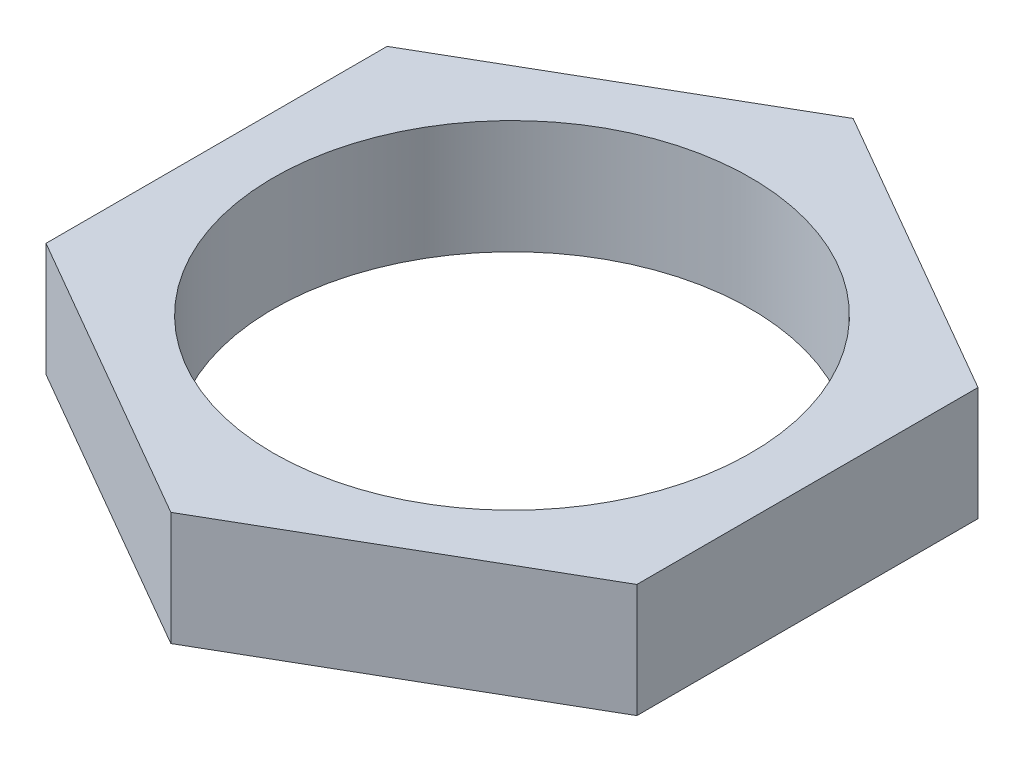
ISO-10303-21;
HEADER;
FILE_DESCRIPTION(('STEP AP214'),'2;1');
FILE_NAME('part.step','',(''),(''),'','','');
FILE_SCHEMA(('AUTOMOTIVE_DESIGN { 1 0 10303 214 1 1 1 1 }'));
ENDSEC;
DATA;
#1=APPLICATION_CONTEXT('core data for automotive mechanical design processes');
#2=APPLICATION_PROTOCOL_DEFINITION('international standard','automotive_design',2000,#1);
#3=PRODUCT_CONTEXT('',#1,'mechanical');
#4=PRODUCT('Part','Part','',(#3));
#5=PRODUCT_RELATED_PRODUCT_CATEGORY('part','',(#4));
#6=PRODUCT_DEFINITION_FORMATION('','',#4);
#7=PRODUCT_DEFINITION_CONTEXT('part definition',#1,'design');
#8=PRODUCT_DEFINITION('design','',#6,#7);
#9=PRODUCT_DEFINITION_SHAPE('','',#8);
#10=(LENGTH_UNIT() NAMED_UNIT(*) SI_UNIT(.MILLI.,.METRE.));
#11=(NAMED_UNIT(*) PLANE_ANGLE_UNIT() SI_UNIT($,.RADIAN.));
#12=(NAMED_UNIT(*) SI_UNIT($,.STERADIAN.) SOLID_ANGLE_UNIT());
#13=UNCERTAINTY_MEASURE_WITH_UNIT(LENGTH_MEASURE(1.E-05),#10,'distance_accuracy_value','');
#14=(GEOMETRIC_REPRESENTATION_CONTEXT(3) GLOBAL_UNCERTAINTY_ASSIGNED_CONTEXT((#13)) GLOBAL_UNIT_ASSIGNED_CONTEXT((#10,
#11,#12)) REPRESENTATION_CONTEXT('',''));
#15=CARTESIAN_POINT('',(0.,0.,0.));
#16=DIRECTION('',(0.,0.,1.));
#17=DIRECTION('',(1.,0.,0.));
#18=AXIS2_PLACEMENT_3D('',#15,#16,#17);
#19=CARTESIAN_POINT('',(0.,5.,0.));
#20=DIRECTION('',(0.,1.,0.));
#21=DIRECTION('',(0.,0.,1.));
#22=AXIS2_PLACEMENT_3D('',#19,#20,#21);
#23=PLANE('',#22);
#24=DIRECTION('',(-0.866025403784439,0.,-0.5));
#25=VECTOR('',#24,1.);
#26=CARTESIAN_POINT('',(13.,5.,-7.50555349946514));
#27=LINE('',#26,#25);
#28=CARTESIAN_POINT('',(13.,5.,-7.50555349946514));
#29=VERTEX_POINT('',#28);
#30=CARTESIAN_POINT('',(0.,5.,-15.0111069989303));
#31=VERTEX_POINT('',#30);
#32=EDGE_CURVE('E129',#29,#31,#27,.T.);
#33=ORIENTED_EDGE('',*,*,#32,.T.);
#34=DIRECTION('',(-0.866025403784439,0.,0.5));
#35=VECTOR('',#34,1.);
#36=CARTESIAN_POINT('',(0.,5.,-15.0111069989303));
#37=LINE('',#36,#35);
#38=CARTESIAN_POINT('',(-13.,5.,-7.50555349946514));
#39=VERTEX_POINT('',#38);
#40=EDGE_CURVE('E87',#31,#39,#37,.T.);
#41=ORIENTED_EDGE('',*,*,#40,.T.);
#42=DIRECTION('',(0.,0.,1.));
#43=VECTOR('',#42,1.);
#44=CARTESIAN_POINT('',(-13.,5.,-7.50555349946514));
#45=LINE('',#44,#43);
#46=CARTESIAN_POINT('',(-13.,5.,7.50555349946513));
#47=VERTEX_POINT('',#46);
#48=EDGE_CURVE('E100',#39,#47,#45,.T.);
#49=ORIENTED_EDGE('',*,*,#48,.T.);
#50=DIRECTION('',(0.866025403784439,0.,0.5));
#51=VECTOR('',#50,1.);
#52=CARTESIAN_POINT('',(-13.,5.,7.50555349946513));
#53=LINE('',#52,#51);
#54=CARTESIAN_POINT('',(0.,5.,15.0111069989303));
#55=VERTEX_POINT('',#54);
#56=EDGE_CURVE('E94',#47,#55,#53,.T.);
#57=ORIENTED_EDGE('',*,*,#56,.T.);
#58=DIRECTION('',(0.866025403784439,0.,-0.5));
#59=VECTOR('',#58,1.);
#60=CARTESIAN_POINT('',(0.,5.,15.0111069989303));
#61=LINE('',#60,#59);
#62=CARTESIAN_POINT('',(13.,5.,7.50555349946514));
#63=VERTEX_POINT('',#62);
#64=EDGE_CURVE('E98',#55,#63,#61,.T.);
#65=ORIENTED_EDGE('',*,*,#64,.T.);
#66=DIRECTION('',(0.,0.,-1.));
#67=VECTOR('',#66,1.);
#68=CARTESIAN_POINT('',(13.,5.,7.50555349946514));
#69=LINE('',#68,#67);
#70=EDGE_CURVE('E50',#63,#29,#69,.T.);
#71=ORIENTED_EDGE('',*,*,#70,.T.);
#72=EDGE_LOOP('',(#33,#41,#49,#57,#65,#71));
#73=FACE_BOUND('',#72,.T.);
#74=CARTESIAN_POINT('',(0.,5.,0.));
#75=DIRECTION('',(0.,1.,0.));
#76=DIRECTION('',(0.,0.,1.));
#77=AXIS2_PLACEMENT_3D('',#74,#75,#76);
#78=CIRCLE('',#77,10.5);
#79=CARTESIAN_POINT('',(0.,5.,10.5));
#80=VERTEX_POINT('',#79);
#81=EDGE_CURVE('E122',#80,#80,#78,.T.);
#82=ORIENTED_EDGE('',*,*,#81,.F.);
#83=EDGE_LOOP('',(#82));
#84=FACE_BOUND('',#83,.T.);
#85=ADVANCED_FACE('F33',(#73,#84),#23,.T.);
#86=CARTESIAN_POINT('',(0.,0.,0.));
#87=DIRECTION('',(0.,1.,0.));
#88=DIRECTION('',(0.,0.,1.));
#89=AXIS2_PLACEMENT_3D('',#86,#87,#88);
#90=PLANE('',#89);
#91=DIRECTION('',(-0.866025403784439,0.,-0.5));
#92=VECTOR('',#91,1.);
#93=CARTESIAN_POINT('',(13.,0.,-7.50555349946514));
#94=LINE('',#93,#92);
#95=CARTESIAN_POINT('',(13.,0.,-7.50555349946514));
#96=VERTEX_POINT('',#95);
#97=CARTESIAN_POINT('',(0.,0.,-15.0111069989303));
#98=VERTEX_POINT('',#97);
#99=EDGE_CURVE('E118',#96,#98,#94,.T.);
#100=ORIENTED_EDGE('',*,*,#99,.F.);
#101=DIRECTION('',(0.,0.,-1.));
#102=VECTOR('',#101,1.);
#103=CARTESIAN_POINT('',(13.,0.,7.50555349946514));
#104=LINE('',#103,#102);
#105=CARTESIAN_POINT('',(13.,0.,7.50555349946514));
#106=VERTEX_POINT('',#105);
#107=EDGE_CURVE('E79',#106,#96,#104,.T.);
#108=ORIENTED_EDGE('',*,*,#107,.F.);
#109=DIRECTION('',(0.866025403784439,0.,-0.5));
#110=VECTOR('',#109,1.);
#111=CARTESIAN_POINT('',(0.,0.,15.0111069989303));
#112=LINE('',#111,#110);
#113=CARTESIAN_POINT('',(0.,0.,15.0111069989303));
#114=VERTEX_POINT('',#113);
#115=EDGE_CURVE('E73',#114,#106,#112,.T.);
#116=ORIENTED_EDGE('',*,*,#115,.F.);
#117=DIRECTION('',(0.866025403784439,0.,0.5));
#118=VECTOR('',#117,1.);
#119=CARTESIAN_POINT('',(-13.,0.,7.50555349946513));
#120=LINE('',#119,#118);
#121=CARTESIAN_POINT('',(-13.,0.,7.50555349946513));
#122=VERTEX_POINT('',#121);
#123=EDGE_CURVE('E108',#122,#114,#120,.T.);
#124=ORIENTED_EDGE('',*,*,#123,.F.);
#125=DIRECTION('',(0.,0.,1.));
#126=VECTOR('',#125,1.);
#127=CARTESIAN_POINT('',(-13.,0.,-7.50555349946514));
#128=LINE('',#127,#126);
#129=CARTESIAN_POINT('',(-13.,0.,-7.50555349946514));
#130=VERTEX_POINT('',#129);
#131=EDGE_CURVE('E124',#130,#122,#128,.T.);
#132=ORIENTED_EDGE('',*,*,#131,.F.);
#133=DIRECTION('',(-0.866025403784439,0.,0.5));
#134=VECTOR('',#133,1.);
#135=CARTESIAN_POINT('',(0.,0.,-15.0111069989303));
#136=LINE('',#135,#134);
#137=EDGE_CURVE('E121',#98,#130,#136,.T.);
#138=ORIENTED_EDGE('',*,*,#137,.F.);
#139=EDGE_LOOP('',(#100,#108,#116,#124,#132,#138));
#140=FACE_BOUND('',#139,.T.);
#141=CARTESIAN_POINT('',(0.,0.,0.));
#142=DIRECTION('',(0.,1.,0.));
#143=DIRECTION('',(0.,0.,1.));
#144=AXIS2_PLACEMENT_3D('',#141,#142,#143);
#145=CIRCLE('',#144,10.5);
#146=CARTESIAN_POINT('',(0.,0.,10.5));
#147=VERTEX_POINT('',#146);
#148=EDGE_CURVE('E222',#147,#147,#145,.T.);
#149=ORIENTED_EDGE('',*,*,#148,.T.);
#150=EDGE_LOOP('',(#149));
#151=FACE_BOUND('',#150,.T.);
#152=ADVANCED_FACE('F138',(#140,#151),#90,.F.);
#153=CARTESIAN_POINT('',(13.,5.,-7.50555349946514));
#154=DIRECTION('',(-0.5,0.,0.866025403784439));
#155=DIRECTION('',(0.866025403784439,0.,0.5));
#156=AXIS2_PLACEMENT_3D('',#153,#154,#155);
#157=PLANE('',#156);
#158=ORIENTED_EDGE('',*,*,#99,.T.);
#159=DIRECTION('',(0.,-1.,0.));
#160=VECTOR('',#159,1.);
#161=CARTESIAN_POINT('',(0.,5.,-15.0111069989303));
#162=LINE('',#161,#160);
#163=EDGE_CURVE('E11',#31,#98,#162,.T.);
#164=ORIENTED_EDGE('',*,*,#163,.F.);
#165=ORIENTED_EDGE('',*,*,#32,.F.);
#166=DIRECTION('',(0.,-1.,0.));
#167=VECTOR('',#166,1.);
#168=CARTESIAN_POINT('',(13.,5.,-7.50555349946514));
#169=LINE('',#168,#167);
#170=EDGE_CURVE('E114',#29,#96,#169,.T.);
#171=ORIENTED_EDGE('',*,*,#170,.T.);
#172=EDGE_LOOP('',(#158,#164,#165,#171));
#173=FACE_BOUND('',#172,.T.);
#174=ADVANCED_FACE('F35',(#173),#157,.F.);
#175=CARTESIAN_POINT('',(0.,5.,-15.0111069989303));
#176=DIRECTION('',(0.5,0.,0.866025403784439));
#177=DIRECTION('',(0.866025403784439,0.,-0.5));
#178=AXIS2_PLACEMENT_3D('',#175,#176,#177);
#179=PLANE('',#178);
#180=ORIENTED_EDGE('',*,*,#137,.T.);
#181=DIRECTION('',(0.,-1.,0.));
#182=VECTOR('',#181,1.);
#183=CARTESIAN_POINT('',(-13.,5.,-7.50555349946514));
#184=LINE('',#183,#182);
#185=EDGE_CURVE('E42',#39,#130,#184,.T.);
#186=ORIENTED_EDGE('',*,*,#185,.F.);
#187=ORIENTED_EDGE('',*,*,#40,.F.);
#188=ORIENTED_EDGE('',*,*,#163,.T.);
#189=EDGE_LOOP('',(#180,#186,#187,#188));
#190=FACE_BOUND('',#189,.T.);
#191=ADVANCED_FACE('F163',(#190),#179,.F.);
#192=CARTESIAN_POINT('',(-13.,5.,-7.50555349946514));
#193=DIRECTION('',(1.,0.,0.));
#194=DIRECTION('',(0.,0.,-1.));
#195=AXIS2_PLACEMENT_3D('',#192,#193,#194);
#196=PLANE('',#195);
#197=ORIENTED_EDGE('',*,*,#131,.T.);
#198=DIRECTION('',(0.,-1.,0.));
#199=VECTOR('',#198,1.);
#200=CARTESIAN_POINT('',(-13.,5.,7.50555349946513));
#201=LINE('',#200,#199);
#202=EDGE_CURVE('E109',#47,#122,#201,.T.);
#203=ORIENTED_EDGE('',*,*,#202,.F.);
#204=ORIENTED_EDGE('',*,*,#48,.F.);
#205=ORIENTED_EDGE('',*,*,#185,.T.);
#206=EDGE_LOOP('',(#197,#203,#204,#205));
#207=FACE_BOUND('',#206,.T.);
#208=ADVANCED_FACE('F135',(#207),#196,.F.);
#209=CARTESIAN_POINT('',(-13.,5.,7.50555349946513));
#210=DIRECTION('',(0.5,0.,-0.866025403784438));
#211=DIRECTION('',(-0.866025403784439,0.,-0.5));
#212=AXIS2_PLACEMENT_3D('',#209,#210,#211);
#213=PLANE('',#212);
#214=ORIENTED_EDGE('',*,*,#123,.T.);
#215=DIRECTION('',(0.,-1.,0.));
#216=VECTOR('',#215,1.);
#217=CARTESIAN_POINT('',(0.,5.,15.0111069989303));
#218=LINE('',#217,#216);
#219=EDGE_CURVE('E105',#55,#114,#218,.T.);
#220=ORIENTED_EDGE('',*,*,#219,.F.);
#221=ORIENTED_EDGE('',*,*,#56,.F.);
#222=ORIENTED_EDGE('',*,*,#202,.T.);
#223=EDGE_LOOP('',(#214,#220,#221,#222));
#224=FACE_BOUND('',#223,.T.);
#225=ADVANCED_FACE('F106',(#224),#213,.F.);
#226=CARTESIAN_POINT('',(0.,5.,15.0111069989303));
#227=DIRECTION('',(-0.5,0.,-0.866025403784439));
#228=DIRECTION('',(-0.866025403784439,0.,0.5));
#229=AXIS2_PLACEMENT_3D('',#226,#227,#228);
#230=PLANE('',#229);
#231=ORIENTED_EDGE('',*,*,#115,.T.);
#232=DIRECTION('',(0.,-1.,0.));
#233=VECTOR('',#232,1.);
#234=CARTESIAN_POINT('',(13.,5.,7.50555349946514));
#235=LINE('',#234,#233);
#236=EDGE_CURVE('E110',#63,#106,#235,.T.);
#237=ORIENTED_EDGE('',*,*,#236,.F.);
#238=ORIENTED_EDGE('',*,*,#64,.F.);
#239=ORIENTED_EDGE('',*,*,#219,.T.);
#240=EDGE_LOOP('',(#231,#237,#238,#239));
#241=FACE_BOUND('',#240,.T.);
#242=ADVANCED_FACE('F112',(#241),#230,.F.);
#243=CARTESIAN_POINT('',(13.,5.,7.50555349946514));
#244=DIRECTION('',(-1.,0.,0.));
#245=DIRECTION('',(0.,0.,1.));
#246=AXIS2_PLACEMENT_3D('',#243,#244,#245);
#247=PLANE('',#246);
#248=ORIENTED_EDGE('',*,*,#107,.T.);
#249=ORIENTED_EDGE('',*,*,#170,.F.);
#250=ORIENTED_EDGE('',*,*,#70,.F.);
#251=ORIENTED_EDGE('',*,*,#236,.T.);
#252=EDGE_LOOP('',(#248,#249,#250,#251));
#253=FACE_BOUND('',#252,.T.);
#254=ADVANCED_FACE('F143',(#253),#247,.F.);
#255=CARTESIAN_POINT('',(0.,5.,0.));
#256=DIRECTION('',(0.,-1.,0.));
#257=DIRECTION('',(0.,0.,-1.));
#258=AXIS2_PLACEMENT_3D('',#255,#256,#257);
#259=CYLINDRICAL_SURFACE('',#258,10.5);
#260=ORIENTED_EDGE('',*,*,#81,.T.);
#261=EDGE_LOOP('',(#260));
#262=FACE_BOUND('',#261,.T.);
#263=ORIENTED_EDGE('',*,*,#148,.F.);
#264=EDGE_LOOP('',(#263));
#265=FACE_BOUND('',#264,.T.);
#266=ADVANCED_FACE('F145',(#262,#265),#259,.F.);
#267=CLOSED_SHELL('',(#85,#152,#174,#191,#208,#225,#242,#254,#266));
#268=MANIFOLD_SOLID_BREP('B2',#267);
#269=ADVANCED_BREP_SHAPE_REPRESENTATION('',(#18,#268),#14);
#270=SHAPE_DEFINITION_REPRESENTATION(#9,#269);
ENDSEC;
END-ISO-10303-21;
